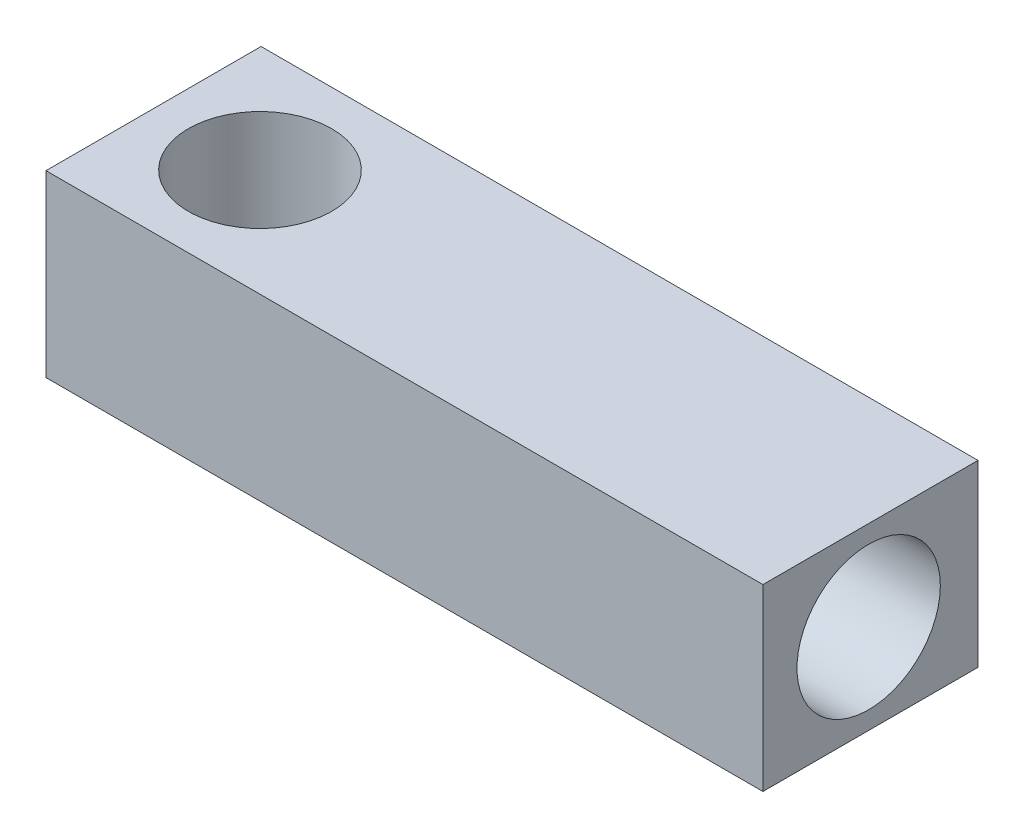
ISO-10303-21;
HEADER;
FILE_DESCRIPTION(('STEP AP214'),'2;1');
FILE_NAME('part.step','',(''),(''),'','','');
FILE_SCHEMA(('AUTOMOTIVE_DESIGN { 1 0 10303 214 1 1 1 1 }'));
ENDSEC;
DATA;
#1=APPLICATION_CONTEXT('core data for automotive mechanical design processes');
#2=APPLICATION_PROTOCOL_DEFINITION('international standard','automotive_design',2000,#1);
#3=PRODUCT_CONTEXT('',#1,'mechanical');
#4=PRODUCT('Part','Part','',(#3));
#5=PRODUCT_RELATED_PRODUCT_CATEGORY('part','',(#4));
#6=PRODUCT_DEFINITION_FORMATION('','',#4);
#7=PRODUCT_DEFINITION_CONTEXT('part definition',#1,'design');
#8=PRODUCT_DEFINITION('design','',#6,#7);
#9=PRODUCT_DEFINITION_SHAPE('','',#8);
#10=(LENGTH_UNIT() NAMED_UNIT(*) SI_UNIT(.MILLI.,.METRE.));
#11=(NAMED_UNIT(*) PLANE_ANGLE_UNIT() SI_UNIT($,.RADIAN.));
#12=(NAMED_UNIT(*) SI_UNIT($,.STERADIAN.) SOLID_ANGLE_UNIT());
#13=UNCERTAINTY_MEASURE_WITH_UNIT(LENGTH_MEASURE(1.E-05),#10,'distance_accuracy_value','');
#14=(GEOMETRIC_REPRESENTATION_CONTEXT(3) GLOBAL_UNCERTAINTY_ASSIGNED_CONTEXT((#13)) GLOBAL_UNIT_ASSIGNED_CONTEXT((#10,
#11,#12)) REPRESENTATION_CONTEXT('',''));
#15=CARTESIAN_POINT('',(0.,0.,0.));
#16=DIRECTION('',(0.,0.,1.));
#17=DIRECTION('',(1.,0.,0.));
#18=AXIS2_PLACEMENT_3D('',#15,#16,#17);
#19=CARTESIAN_POINT('',(-60.7935843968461,9.23040842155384,30.));
#20=DIRECTION('',(1.,0.,0.));
#21=DIRECTION('',(0.,0.,-1.));
#22=AXIS2_PLACEMENT_3D('',#19,#20,#21);
#23=PLANE('',#22);
#24=DIRECTION('',(0.,-1.,0.));
#25=VECTOR('',#24,1.);
#26=CARTESIAN_POINT('',(-60.7935843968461,9.23040842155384,0.));
#27=LINE('',#26,#25);
#28=CARTESIAN_POINT('',(-60.7935843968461,9.23040842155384,0.));
#29=VERTEX_POINT('',#28);
#30=CARTESIAN_POINT('',(-60.7935843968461,-15.7695915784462,0.));
#31=VERTEX_POINT('',#30);
#32=EDGE_CURVE('E98',#29,#31,#27,.T.);
#33=ORIENTED_EDGE('',*,*,#32,.T.);
#34=DIRECTION('',(0.,0.,-1.));
#35=VECTOR('',#34,1.);
#36=CARTESIAN_POINT('',(-60.7935843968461,-15.7695915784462,30.));
#37=LINE('',#36,#35);
#38=CARTESIAN_POINT('',(-60.7935843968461,-15.7695915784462,30.));
#39=VERTEX_POINT('',#38);
#40=EDGE_CURVE('E11',#39,#31,#37,.T.);
#41=ORIENTED_EDGE('',*,*,#40,.F.);
#42=DIRECTION('',(0.,-1.,0.));
#43=VECTOR('',#42,1.);
#44=CARTESIAN_POINT('',(-60.7935843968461,9.23040842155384,30.));
#45=LINE('',#44,#43);
#46=CARTESIAN_POINT('',(-60.7935843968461,9.23040842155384,30.));
#47=VERTEX_POINT('',#46);
#48=EDGE_CURVE('E85',#47,#39,#45,.T.);
#49=ORIENTED_EDGE('',*,*,#48,.F.);
#50=DIRECTION('',(0.,0.,-1.));
#51=VECTOR('',#50,1.);
#52=CARTESIAN_POINT('',(-60.7935843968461,9.23040842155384,30.));
#53=LINE('',#52,#51);
#54=EDGE_CURVE('E94',#47,#29,#53,.T.);
#55=ORIENTED_EDGE('',*,*,#54,.T.);
#56=EDGE_LOOP('',(#33,#41,#49,#55));
#57=FACE_BOUND('',#56,.T.);
#58=ADVANCED_FACE('F33',(#57),#23,.F.);
#59=CARTESIAN_POINT('',(-60.7935843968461,-15.7695915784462,30.));
#60=DIRECTION('',(0.,1.,0.));
#61=DIRECTION('',(0.,0.,1.));
#62=AXIS2_PLACEMENT_3D('',#59,#60,#61);
#63=PLANE('',#62);
#64=CARTESIAN_POINT('',(-45.9431395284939,-15.7695915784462,15.));
#65=DIRECTION('',(0.,-1.,0.));
#66=DIRECTION('',(0.,0.,-1.));
#67=AXIS2_PLACEMENT_3D('',#64,#65,#66);
#68=CIRCLE('',#67,10.);
#69=CARTESIAN_POINT('',(-45.9431395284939,-15.7695915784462,5.));
#70=VERTEX_POINT('',#69);
#71=EDGE_CURVE('E117',#70,#70,#68,.T.);
#72=ORIENTED_EDGE('',*,*,#71,.F.);
#73=EDGE_LOOP('',(#72));
#74=FACE_BOUND('',#73,.T.);
#75=DIRECTION('',(1.,0.,0.));
#76=VECTOR('',#75,1.);
#77=CARTESIAN_POINT('',(-60.7935843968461,-15.7695915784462,0.));
#78=LINE('',#77,#76);
#79=CARTESIAN_POINT('',(39.2064156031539,-15.7695915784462,0.));
#80=VERTEX_POINT('',#79);
#81=EDGE_CURVE('E89',#31,#80,#78,.T.);
#82=ORIENTED_EDGE('',*,*,#81,.T.);
#83=DIRECTION('',(0.,0.,-1.));
#84=VECTOR('',#83,1.);
#85=CARTESIAN_POINT('',(39.2064156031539,-15.7695915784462,30.));
#86=LINE('',#85,#84);
#87=CARTESIAN_POINT('',(39.2064156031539,-15.7695915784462,30.));
#88=VERTEX_POINT('',#87);
#89=EDGE_CURVE('E42',#88,#80,#86,.T.);
#90=ORIENTED_EDGE('',*,*,#89,.F.);
#91=DIRECTION('',(1.,0.,0.));
#92=VECTOR('',#91,1.);
#93=CARTESIAN_POINT('',(-60.7935843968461,-15.7695915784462,30.));
#94=LINE('',#93,#92);
#95=EDGE_CURVE('E80',#39,#88,#94,.T.);
#96=ORIENTED_EDGE('',*,*,#95,.F.);
#97=ORIENTED_EDGE('',*,*,#40,.T.);
#98=EDGE_LOOP('',(#82,#90,#96,#97));
#99=FACE_BOUND('',#98,.T.);
#100=ADVANCED_FACE('F88',(#74,#99),#63,.F.);
#101=CARTESIAN_POINT('',(39.2064156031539,9.23040842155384,30.));
#102=DIRECTION('',(-1.,0.,0.));
#103=DIRECTION('',(0.,0.,1.));
#104=AXIS2_PLACEMENT_3D('',#101,#102,#103);
#105=PLANE('',#104);
#106=CARTESIAN_POINT('',(39.2064156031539,-3.26959157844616,15.2518027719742));
#107=DIRECTION('',(1.,0.,0.));
#108=DIRECTION('',(0.,0.,-1.));
#109=AXIS2_PLACEMENT_3D('',#106,#107,#108);
#110=CIRCLE('',#109,10.);
#111=CARTESIAN_POINT('',(39.2064156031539,-3.26959157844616,5.25180277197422));
#112=VERTEX_POINT('',#111);
#113=EDGE_CURVE('E112',#112,#112,#110,.T.);
#114=ORIENTED_EDGE('',*,*,#113,.F.);
#115=EDGE_LOOP('',(#114));
#116=FACE_BOUND('',#115,.T.);
#117=DIRECTION('',(0.,1.,0.));
#118=VECTOR('',#117,1.);
#119=CARTESIAN_POINT('',(39.2064156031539,9.23040842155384,0.));
#120=LINE('',#119,#118);
#121=CARTESIAN_POINT('',(39.2064156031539,9.23040842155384,0.));
#122=VERTEX_POINT('',#121);
#123=EDGE_CURVE('E67',#80,#122,#120,.T.);
#124=ORIENTED_EDGE('',*,*,#123,.T.);
#125=DIRECTION('',(0.,0.,-1.));
#126=VECTOR('',#125,1.);
#127=CARTESIAN_POINT('',(39.2064156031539,9.23040842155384,30.));
#128=LINE('',#127,#126);
#129=CARTESIAN_POINT('',(39.2064156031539,9.23040842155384,30.));
#130=VERTEX_POINT('',#129);
#131=EDGE_CURVE('E90',#130,#122,#128,.T.);
#132=ORIENTED_EDGE('',*,*,#131,.F.);
#133=DIRECTION('',(0.,1.,0.));
#134=VECTOR('',#133,1.);
#135=CARTESIAN_POINT('',(39.2064156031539,9.23040842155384,30.));
#136=LINE('',#135,#134);
#137=EDGE_CURVE('E83',#88,#130,#136,.T.);
#138=ORIENTED_EDGE('',*,*,#137,.F.);
#139=ORIENTED_EDGE('',*,*,#89,.T.);
#140=EDGE_LOOP('',(#124,#132,#138,#139));
#141=FACE_BOUND('',#140,.T.);
#142=ADVANCED_FACE('F92',(#116,#141),#105,.F.);
#143=CARTESIAN_POINT('',(-60.7935843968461,9.23040842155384,30.));
#144=DIRECTION('',(0.,-1.,0.));
#145=DIRECTION('',(0.,0.,-1.));
#146=AXIS2_PLACEMENT_3D('',#143,#144,#145);
#147=PLANE('',#146);
#148=CARTESIAN_POINT('',(-45.9431395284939,9.23040842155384,15.));
#149=DIRECTION('',(0.,-1.,0.));
#150=DIRECTION('',(0.,0.,-1.));
#151=AXIS2_PLACEMENT_3D('',#148,#149,#150);
#152=CIRCLE('',#151,10.);
#153=CARTESIAN_POINT('',(-45.9431395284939,9.23040842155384,5.));
#154=VERTEX_POINT('',#153);
#155=EDGE_CURVE('E36',#154,#154,#152,.T.);
#156=ORIENTED_EDGE('',*,*,#155,.T.);
#157=EDGE_LOOP('',(#156));
#158=FACE_BOUND('',#157,.T.);
#159=DIRECTION('',(-1.,0.,0.));
#160=VECTOR('',#159,1.);
#161=CARTESIAN_POINT('',(-60.7935843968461,9.23040842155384,0.));
#162=LINE('',#161,#160);
#163=EDGE_CURVE('E73',#122,#29,#162,.T.);
#164=ORIENTED_EDGE('',*,*,#163,.T.);
#165=ORIENTED_EDGE('',*,*,#54,.F.);
#166=DIRECTION('',(-1.,0.,0.));
#167=VECTOR('',#166,1.);
#168=CARTESIAN_POINT('',(-60.7935843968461,9.23040842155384,30.));
#169=LINE('',#168,#167);
#170=EDGE_CURVE('E50',#130,#47,#169,.T.);
#171=ORIENTED_EDGE('',*,*,#170,.F.);
#172=ORIENTED_EDGE('',*,*,#131,.T.);
#173=EDGE_LOOP('',(#164,#165,#171,#172));
#174=FACE_BOUND('',#173,.T.);
#175=ADVANCED_FACE('F106',(#158,#174),#147,.F.);
#176=CARTESIAN_POINT('',(0.,0.,30.));
#177=DIRECTION('',(0.,0.,1.));
#178=DIRECTION('',(1.,0.,0.));
#179=AXIS2_PLACEMENT_3D('',#176,#177,#178);
#180=PLANE('',#179);
#181=ORIENTED_EDGE('',*,*,#48,.T.);
#182=ORIENTED_EDGE('',*,*,#95,.T.);
#183=ORIENTED_EDGE('',*,*,#137,.T.);
#184=ORIENTED_EDGE('',*,*,#170,.T.);
#185=EDGE_LOOP('',(#181,#182,#183,#184));
#186=FACE_BOUND('',#185,.T.);
#187=ADVANCED_FACE('F81',(#186),#180,.T.);
#188=CARTESIAN_POINT('',(0.,0.,0.));
#189=DIRECTION('',(0.,0.,1.));
#190=DIRECTION('',(1.,0.,0.));
#191=AXIS2_PLACEMENT_3D('',#188,#189,#190);
#192=PLANE('',#191);
#193=ORIENTED_EDGE('',*,*,#32,.F.);
#194=ORIENTED_EDGE('',*,*,#163,.F.);
#195=ORIENTED_EDGE('',*,*,#123,.F.);
#196=ORIENTED_EDGE('',*,*,#81,.F.);
#197=EDGE_LOOP('',(#193,#194,#195,#196));
#198=FACE_BOUND('',#197,.T.);
#199=ADVANCED_FACE('F109',(#198),#192,.F.);
#200=CARTESIAN_POINT('',(-15.7935843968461,-3.26959157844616,15.2518027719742));
#201=DIRECTION('',(1.,0.,0.));
#202=DIRECTION('',(0.,0.,-1.));
#203=AXIS2_PLACEMENT_3D('',#200,#201,#202);
#204=CYLINDRICAL_SURFACE('',#203,10.);
#205=CARTESIAN_POINT('',(-15.7935843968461,-3.26959157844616,15.2518027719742));
#206=DIRECTION('',(1.,0.,0.));
#207=DIRECTION('',(0.,0.,-1.));
#208=AXIS2_PLACEMENT_3D('',#205,#206,#207);
#209=CIRCLE('',#208,10.);
#210=CARTESIAN_POINT('',(-15.7935843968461,-3.26959157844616,5.25180277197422));
#211=VERTEX_POINT('',#210);
#212=EDGE_CURVE('E101',#211,#211,#209,.T.);
#213=ORIENTED_EDGE('',*,*,#212,.F.);
#214=EDGE_LOOP('',(#213));
#215=FACE_BOUND('',#214,.T.);
#216=ORIENTED_EDGE('',*,*,#113,.T.);
#217=EDGE_LOOP('',(#216));
#218=FACE_BOUND('',#217,.T.);
#219=ADVANCED_FACE('F132',(#215,#218),#204,.F.);
#220=CARTESIAN_POINT('',(-15.7935843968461,-3.26959157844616,15.2518027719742));
#221=DIRECTION('',(1.,0.,0.));
#222=DIRECTION('',(0.,0.,-1.));
#223=AXIS2_PLACEMENT_3D('',#220,#221,#222);
#224=PLANE('',#223);
#225=ORIENTED_EDGE('',*,*,#212,.T.);
#226=EDGE_LOOP('',(#225));
#227=FACE_BOUND('',#226,.T.);
#228=ADVANCED_FACE('F127',(#227),#224,.T.);
#229=CARTESIAN_POINT('',(-45.9431395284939,39.2304084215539,15.));
#230=DIRECTION('',(0.,-1.,0.));
#231=DIRECTION('',(0.,0.,-1.));
#232=AXIS2_PLACEMENT_3D('',#229,#230,#231);
#233=CYLINDRICAL_SURFACE('',#232,10.);
#234=ORIENTED_EDGE('',*,*,#71,.T.);
#235=EDGE_LOOP('',(#234));
#236=FACE_BOUND('',#235,.T.);
#237=ORIENTED_EDGE('',*,*,#155,.F.);
#238=EDGE_LOOP('',(#237));
#239=FACE_BOUND('',#238,.T.);
#240=ADVANCED_FACE('F125',(#236,#239),#233,.F.);
#241=CLOSED_SHELL('',(#58,#100,#142,#175,#187,#199,#219,#228,#240));
#242=MANIFOLD_SOLID_BREP('B2',#241);
#243=ADVANCED_BREP_SHAPE_REPRESENTATION('',(#18,#242),#14);
#244=SHAPE_DEFINITION_REPRESENTATION(#9,#243);
ENDSEC;
END-ISO-10303-21;
